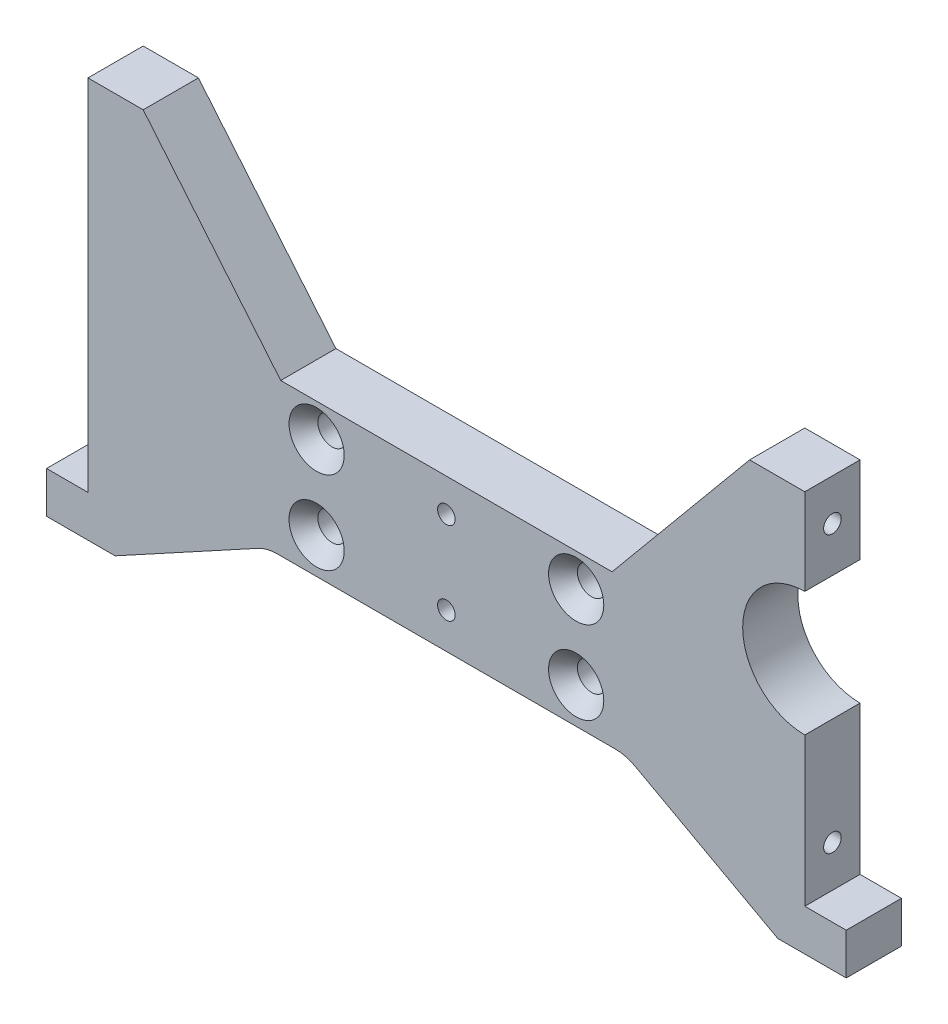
from build123d import *

# Parameters (mm, degrees)
BOSS_EXTRUDE1_DEPTH                = 12.7
CUT_EXTRUDE1_DEPTH                 = 125.218465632
F_0_257_DIAMETER_HOLE2_D           = 6.5278
F_0_257_DIAMETER_HOLE2_CSINK_D     = 12.7
F_0_257_DIAMETER_HOLE2_CSINK_ANGLE = 82
F_10_32_TAPPED_HOLE3_D             = 4.0386
F_10_32_TAPPED_HOLE1_D             = 4.0386
F_10_32_TAPPED_HOLE1_DEPTH         = 12.0396
F_10_32_TAPPED_HOLE1_TIP           = 1.213317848
F_10_32_TAPPED_HOLE2_D             = 4.0386
F_10_32_TAPPED_HOLE2_DEPTH         = 12.0396
F_10_32_TAPPED_HOLE2_TIP           = 1.213317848
REV_A_DEPTH                        = 125.218465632
FILLET1_R                          = 9.525


with BuildPart() as part:
    # Sketch2 → Boss-Extrude1 (new body)
    with BuildSketch(Plane.XY):
        with BuildLine():
            Line((-82.423, 19.8374), (-82.423, 0))
            Line((-82.423, 0), (-91.948, 0))
            Line((-91.948, 0), (-91.948, -9.525))
            Line((-91.948, -9.525), (91.948, -9.525))
            Line((91.948, -9.525), (91.948, 0))
            Line((91.948, 0), (82.423, 0))
            Line((82.423, 0), (82.423, 34.1122))
            ThreePointArc((82.423, 34.1122), (68.1355, 48.3997), (82.423, 62.6872))
            Line((82.423, 62.6872), (82.423, 82.55))
            Line((82.423, 82.55), (-82.423, 82.55))
            Line((-82.423, 82.55), (-82.423, 19.8374))
        make_face()
    extrude(amount=-BOSS_EXTRUDE1_DEPTH)

    # Sketch14 → Cut-Extrude1 (cut, through all)
    with BuildSketch(Plane.XY):
        Polygon((-69.723, 82.55), (-38.1, 44.45), (38.1, 44.45), (69.723, 82.55), align=None)
    extrude(amount=-CUT_EXTRUDE1_DEPTH, mode=Mode.SUBTRACT)

    # F _0.257_ Diameter Hole2 (through all)
    with Locations(Plane.XY):
        with Locations((-29.845, 36.83), (-29.845, 17.78), (29.845, 17.78), (29.845, 36.83)):
            CounterSinkHole(F_0_257_DIAMETER_HOLE2_D / 2, F_0_257_DIAMETER_HOLE2_CSINK_D / 2, counter_sink_angle=F_0_257_DIAMETER_HOLE2_CSINK_ANGLE)

    # 10-32 Tapped Hole3 (through all)
    with Locations(Plane.XY):
        with Locations((0, 36.83), (0, 17.78), (0, -1.27)):
            Hole(F_10_32_TAPPED_HOLE3_D / 2)

    # 10-32 Tapped Hole1
    with Locations(Plane(origin=(82.423, 0, 0), x_dir=(0, 0, -1), z_dir=(1, 0, 0))):
        with Locations((6.35, 73.025), (6.35, 9.525)):
            Hole(F_10_32_TAPPED_HOLE1_D / 2, depth=F_10_32_TAPPED_HOLE1_DEPTH)
            with Locations((0, 0, -(F_10_32_TAPPED_HOLE1_DEPTH + F_10_32_TAPPED_HOLE1_TIP / 2))):  # 118° drill point
                Cone(0, F_10_32_TAPPED_HOLE1_D / 2, F_10_32_TAPPED_HOLE1_TIP, mode=Mode.SUBTRACT)

    # 10-32 Tapped Hole2
    with Locations(Plane.ZY.offset(82.423)):
        with Locations((-6.35, 9.525), (-6.35, 73.025)):
            Hole(F_10_32_TAPPED_HOLE2_D / 2, depth=F_10_32_TAPPED_HOLE2_DEPTH)
            with Locations((0, 0, -(F_10_32_TAPPED_HOLE2_DEPTH + F_10_32_TAPPED_HOLE2_TIP / 2))):  # 118° drill point
                Cone(0, F_10_32_TAPPED_HOLE2_D / 2, F_10_32_TAPPED_HOLE2_TIP, mode=Mode.SUBTRACT)

    # Sketch15 → Rev.A (cut, through all)
    with BuildSketch(Plane(origin=(0, 0, -12.7), x_dir=(-1, 0, 0), z_dir=(0, 0, -1))):
        Polygon((-41.275, 9.525), (41.275, 9.525), (76.2, -9.525), (-76.2, -9.525), align=None)
    extrude(amount=-REV_A_DEPTH, mode=Mode.SUBTRACT)

    # Fillet1
    fillet1_edges = [part.edges().sort_by_distance(p)[0] for p in [
        (41.275, 9.525, -6.35),
        (-41.275, 9.525, -6.35),
    ]]
    fillet(fillet1_edges, radius=FILLET1_R)


solid = part.part
